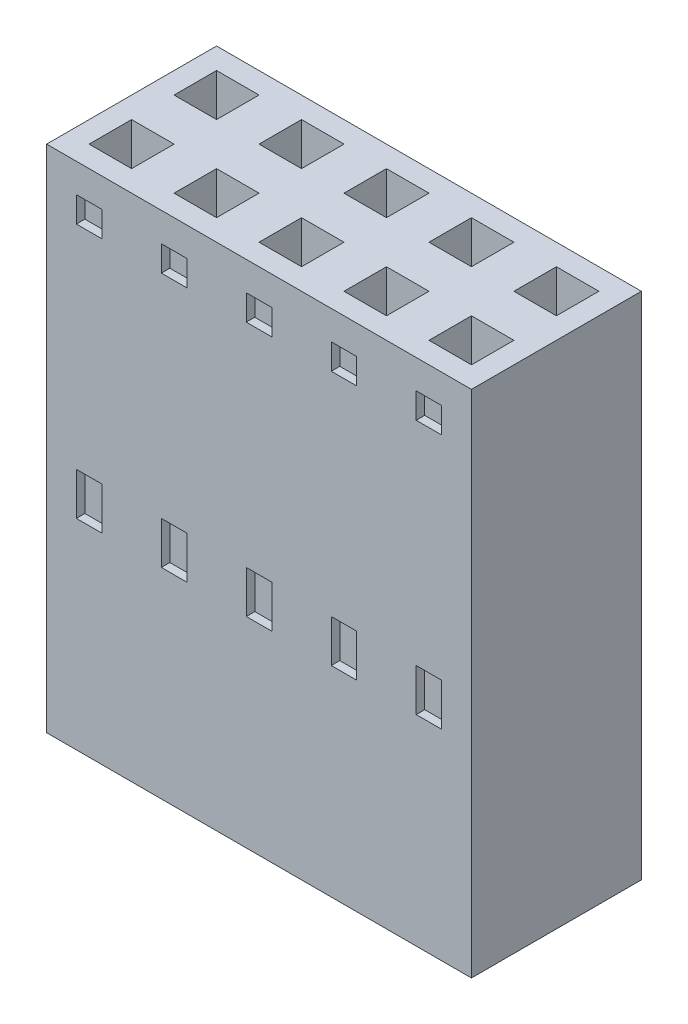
from build123d import *

# Parameters (mm, degrees)
SKETCH1_W                  = 12.7
SKETCH1_H                  = 5.08
BOSS_EXTRUDE1_DEPTH        = 15.24
SKETCH2_W                  = 1.016
SKETCH2_H                  = 1.016
CUT_EXTRUDE1_DEPTH         = 17.704241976
CUT_EXTRUDE2_START         = -0.635
SKETCH3_W                  = 1.27
SKETCH3_H                  = 1.27
CUT_EXTRUDE2_DEPTH         = 17.069241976
CHAMFER1_SIZE              = 0.381
LPATTERN1_COUNT            = 2
LPATTERN1_PITCH            = 2.54
LPATTERN1_COUNT_DIR2       = 5
LPATTERN1_PITCH_DIR2       = 2.54
CHAMFER1_OF_LPATTERN1_SIZE = 0.381
SKETCH4_W                  = 0.762
SKETCH4_H                  = 0.762
SKETCH4_H_2                = 1.27
CUT_EXTRUDE3_DEPTH         = 0.254
LPATTERN2_COUNT            = 5
LPATTERN2_PITCH            = 2.54


with BuildPart() as part:
    # Sketch1 → Boss-Extrude1 (new body)
    with BuildSketch(Plane(origin=(0, 0, 0), x_dir=(1, 0, 0), z_dir=(0, 1, 0))):
        Rectangle(SKETCH1_W, SKETCH1_H)
    extrude(amount=BOSS_EXTRUDE1_DEPTH)

    # Sketch2 → Cut-Extrude1 (cut, through all)
    with BuildSketch(Plane(origin=(0, 0, 0), x_dir=(1, 0, 0), z_dir=(0, 1, 0))):
        with Locations((-5.08, -1.27)):
            Rectangle(SKETCH2_W, SKETCH2_H)
    cut_extrude1 = extrude(amount=CUT_EXTRUDE1_DEPTH, mode=Mode.SUBTRACT)

    # Sketch3 → Cut-Extrude2 (cut, through all)
    with BuildSketch(Plane.XZ.offset(CUT_EXTRUDE2_START)):
        with Locations((-5.08, 1.27)):
            Rectangle(SKETCH3_W, SKETCH3_H)
    cut_extrude2 = extrude(amount=-CUT_EXTRUDE2_DEPTH, mode=Mode.SUBTRACT)

    # Chamfer1
    chamfer1_edges = [part.edges().sort_by_distance(p)[0] for p in [
        (-5.588, 0, 1.27),
        (-5.08, 0, 1.778),
        (-4.572, 0, 1.27),
        (-5.08, 0, 0.762),
    ]]
    chamfer(chamfer1_edges, length=CHAMFER1_SIZE)

    # LPattern1: Cut-Extrude1, Cut-Extrude2 2 × 5
    with Locations(*[(j * LPATTERN1_PITCH_DIR2, 0, -i * LPATTERN1_PITCH) for i in range(LPATTERN1_COUNT) for j in range(LPATTERN1_COUNT_DIR2) if (i, j) != (0, 0)]):
        add(cut_extrude1, mode=Mode.SUBTRACT)
        add(cut_extrude2, mode=Mode.SUBTRACT)

    # Chamfer1 of LPattern1
    chamfer1_of_lpattern1_edges = [part.edges().sort_by_distance(p)[0] for p in [
        (-3.048, 0, 1.27),
        (-2.54, 0, 1.778),
        (-2.032, 0, 1.27),
        (-2.54, 0, 0.762),
        (-0.508, 0, 1.27),
        (0, 0, 1.778),
        (0.508, 0, 1.27),
        (0, 0, 0.762),
        (2.032, 0, 1.27),
        (2.54, 0, 1.778),
        (3.048, 0, 1.27),
        (2.54, 0, 0.762),
        (4.572, 0, 1.27),
        (5.08, 0, 1.778),
        (5.588, 0, 1.27),
        (5.08, 0, 0.762),
        (-5.588, 0, -1.27),
        (-5.08, 0, -0.762),
        (-4.572, 0, -1.27),
        (-5.08, 0, -1.778),
        (-3.048, 0, -1.27),
        (-2.54, 0, -0.762),
        (-2.032, 0, -1.27),
        (-2.54, 0, -1.778),
        (-0.508, 0, -1.27),
        (0, 0, -0.762),
        (0.508, 0, -1.27),
        (0, 0, -1.778),
        (2.032, 0, -1.27),
        (2.54, 0, -0.762),
        (3.048, 0, -1.27),
        (2.54, 0, -1.778),
        (4.572, 0, -1.27),
        (5.08, 0, -0.762),
        (5.588, 0, -1.27),
        (5.08, 0, -1.778),
    ]]
    chamfer(chamfer1_of_lpattern1_edges, length=CHAMFER1_OF_LPATTERN1_SIZE)

    # Sketch4 → Cut-Extrude3 (cut)
    with BuildSketch(Plane.XY.offset(2.54)):
        with Locations((-5.08, 13.9954)):
            Rectangle(SKETCH4_W, SKETCH4_H)
        with Locations((-5.08, 6.6294)):
            Rectangle(SKETCH4_W, SKETCH4_H_2)
    cut_extrude3 = extrude(amount=-CUT_EXTRUDE3_DEPTH, mode=Mode.SUBTRACT)

    # LPattern2: Cut-Extrude3 ×5
    with Locations(*[(i * LPATTERN2_PITCH, 0, 0) for i in range(1, LPATTERN2_COUNT)]):
        add(cut_extrude3, mode=Mode.SUBTRACT)


solid = part.part
